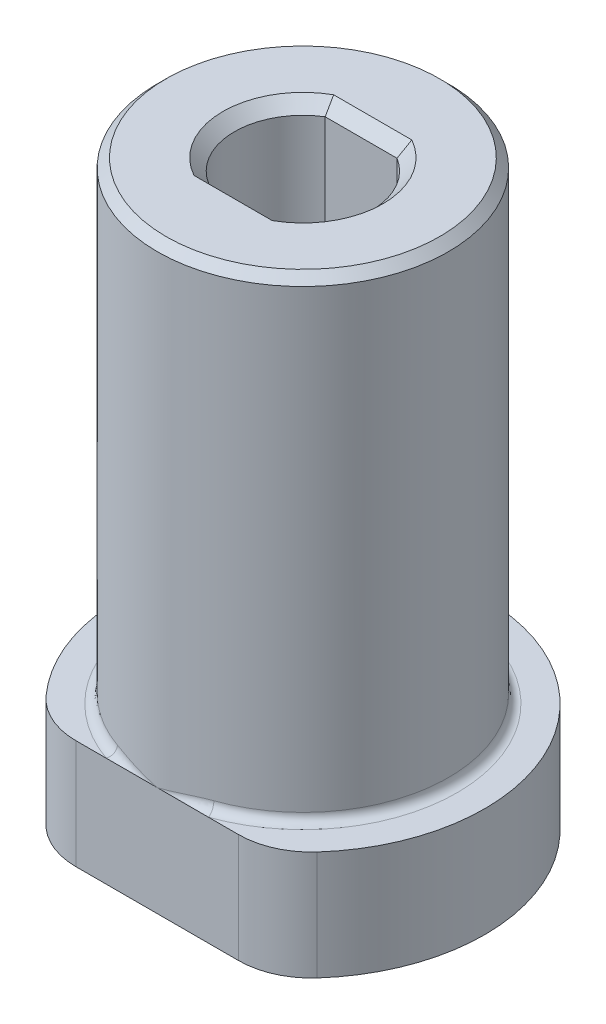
ISO-10303-21;
HEADER;
FILE_DESCRIPTION(('STEP AP214'),'2;1');
FILE_NAME('part.step','',(''),(''),'','','');
FILE_SCHEMA(('AUTOMOTIVE_DESIGN { 1 0 10303 214 1 1 1 1 }'));
ENDSEC;
DATA;
#1=APPLICATION_CONTEXT('core data for automotive mechanical design processes');
#2=APPLICATION_PROTOCOL_DEFINITION('international standard','automotive_design',2000,#1);
#3=PRODUCT_CONTEXT('',#1,'mechanical');
#4=PRODUCT('Part','Part','',(#3));
#5=PRODUCT_RELATED_PRODUCT_CATEGORY('part','',(#4));
#6=PRODUCT_DEFINITION_FORMATION('','',#4);
#7=PRODUCT_DEFINITION_CONTEXT('part definition',#1,'design');
#8=PRODUCT_DEFINITION('design','',#6,#7);
#9=PRODUCT_DEFINITION_SHAPE('','',#8);
#10=(LENGTH_UNIT() NAMED_UNIT(*) SI_UNIT(.MILLI.,.METRE.));
#11=(NAMED_UNIT(*) PLANE_ANGLE_UNIT() SI_UNIT($,.RADIAN.));
#12=(NAMED_UNIT(*) SI_UNIT($,.STERADIAN.) SOLID_ANGLE_UNIT());
#13=UNCERTAINTY_MEASURE_WITH_UNIT(LENGTH_MEASURE(1.E-05),#10,'distance_accuracy_value','');
#14=(GEOMETRIC_REPRESENTATION_CONTEXT(3) GLOBAL_UNCERTAINTY_ASSIGNED_CONTEXT((#13)) GLOBAL_UNIT_ASSIGNED_CONTEXT((#10,
#11,#12)) REPRESENTATION_CONTEXT('',''));
#15=CARTESIAN_POINT('',(0.,0.,0.));
#16=DIRECTION('',(0.,0.,1.));
#17=DIRECTION('',(1.,0.,0.));
#18=AXIS2_PLACEMENT_3D('',#15,#16,#17);
#19=CARTESIAN_POINT('',(0.,25.4,0.));
#20=DIRECTION('',(0.,-1.,0.));
#21=DIRECTION('',(0.,0.,-1.));
#22=AXIS2_PLACEMENT_3D('',#19,#20,#21);
#23=CYLINDRICAL_SURFACE('',#22,6.35);
#24=CARTESIAN_POINT('',(0.,25.019,0.));
#25=DIRECTION('',(0.,1.,0.));
#26=DIRECTION('',(0.,0.,1.));
#27=AXIS2_PLACEMENT_3D('',#24,#25,#26);
#28=CIRCLE('',#27,6.35);
#29=CARTESIAN_POINT('',(0.,25.019,6.35));
#30=VERTEX_POINT('',#29);
#31=EDGE_CURVE('E12',#30,#30,#28,.F.);
#32=ORIENTED_EDGE('',*,*,#31,.T.);
#33=EDGE_LOOP('',(#32));
#34=FACE_BOUND('',#33,.T.);
#35=CARTESIAN_POINT('',(-2.64079902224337,5.06724114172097,5.77483164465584));
#36=CARTESIAN_POINT('',(-2.5793391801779,4.85068522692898,5.80293689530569));
#37=CARTESIAN_POINT('',(-2.63299473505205,4.74749010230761,5.99770734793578));
#38=CARTESIAN_POINT('',(-2.68665028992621,4.64429497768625,6.19247780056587));
#39=CARTESIAN_POINT('',(-2.79924696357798,4.7625,6.35));
#40=CARTESIAN_POINT('',(-2.6233228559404,5.07359151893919,5.78282381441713));
#41=CARTESIAN_POINT('',(-2.56624090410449,4.85864058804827,5.80870378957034));
#42=CARTESIAN_POINT('',(-2.61912385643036,4.75403643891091,5.999442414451));
#43=CARTESIAN_POINT('',(-2.67210495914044,4.64938753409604,6.19016685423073));
#44=CARTESIAN_POINT('',(-2.7807222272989,4.7625,6.35));
#45=CARTESIAN_POINT('',(-2.605671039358,5.0793912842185,5.79079954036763));
#46=CARTESIAN_POINT('',(-2.55251150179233,4.86622995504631,5.81470706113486));
#47=CARTESIAN_POINT('',(-2.60469134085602,4.76037925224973,6.00152016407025));
#48=CARTESIAN_POINT('',(-2.65696733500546,4.65448930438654,6.18831767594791));
#49=CARTESIAN_POINT('',(-2.76201130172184,4.7625,6.35));
#50=CARTESIAN_POINT('',(-2.57008833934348,5.09001659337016,5.80667927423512));
#51=CARTESIAN_POINT('',(-2.52410761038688,4.88062521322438,5.82701755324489));
#52=CARTESIAN_POINT('',(-2.5749205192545,4.77261497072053,6.00621849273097));
#53=CARTESIAN_POINT('',(-2.62582765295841,4.66456572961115,6.18540497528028));
#54=CARTESIAN_POINT('',(-2.72429363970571,4.7625,6.35));
#55=CARTESIAN_POINT('',(-2.55215762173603,5.09484269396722,5.81458332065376));
#56=CARTESIAN_POINT('',(-2.50943374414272,4.88743952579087,5.83332523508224));
#57=CARTESIAN_POINT('',(-2.55958273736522,4.7785081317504,6.00883875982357));
#58=CARTESIAN_POINT('',(-2.6098250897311,4.66954336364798,6.18433540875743));
#59=CARTESIAN_POINT('',(-2.70528707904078,4.7625,6.35));
#60=CARTESIAN_POINT('',(-2.49811443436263,5.10803879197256,5.83810455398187));
#61=CARTESIAN_POINT('',(-2.4645099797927,4.90665701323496,5.85243943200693));
#62=CARTESIAN_POINT('',(-2.51259016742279,4.79543183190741,6.01728947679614));
#63=CARTESIAN_POINT('',(-2.56103864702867,4.68407352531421,6.18207346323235));
#64=CARTESIAN_POINT('',(-2.64800130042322,4.7625,6.35));
#65=CARTESIAN_POINT('',(-2.46166368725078,5.11515676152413,5.85357078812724));
#66=CARTESIAN_POINT('',(-2.43301723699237,4.91802807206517,5.86558774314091));
#67=CARTESIAN_POINT('',(-2.47988531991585,4.80573941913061,6.02371984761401));
#68=CARTESIAN_POINT('',(-2.52710010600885,4.69335401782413,6.18178137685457));
#69=CARTESIAN_POINT('',(-2.6093635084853,4.7625,6.35));
#70=CARTESIAN_POINT('',(-2.38847508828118,5.12670219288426,5.88381196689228));
#71=CARTESIAN_POINT('',(-2.36838343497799,4.93800653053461,5.89193648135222));
#72=CARTESIAN_POINT('',(-2.41293131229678,4.82439155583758,6.03742606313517));
#73=CARTESIAN_POINT('',(-2.45781822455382,4.71068229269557,6.18284584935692));
#74=CARTESIAN_POINT('',(-2.53178359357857,4.7625,6.35));
#75=CARTESIAN_POINT('',(-2.35174199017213,5.13115108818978,5.89859151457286));
#76=CARTESIAN_POINT('',(-2.33524096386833,4.94667356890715,5.90514869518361));
#77=CARTESIAN_POINT('',(-2.3786968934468,4.83275140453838,6.04469459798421));
#78=CARTESIAN_POINT('',(-2.42246682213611,4.7187607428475,6.18417310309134));
#79=CARTESIAN_POINT('',(-2.4928465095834,4.7625,6.35));
#80=CARTESIAN_POINT('',(-2.27782984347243,5.1379218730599,5.9275263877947));
#81=CARTESIAN_POINT('',(-2.26760356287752,4.96174071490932,5.93143301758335));
#82=CARTESIAN_POINT('',(-2.30893967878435,4.84778638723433,6.05971545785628));
#83=CARTESIAN_POINT('',(-2.3505869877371,4.73376580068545,6.18793067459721));
#84=CARTESIAN_POINT('',(-2.41449963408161,4.7625,6.35));
#85=CARTESIAN_POINT('',(-2.24065045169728,5.14024200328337,5.94168118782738));
#86=CARTESIAN_POINT('',(-2.23308549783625,4.96816670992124,5.94451949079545));
#87=CARTESIAN_POINT('',(-2.27341584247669,4.85446012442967,6.067468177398));
#88=CARTESIAN_POINT('',(-2.31403186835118,4.74070926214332,6.1903539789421));
#89=CARTESIAN_POINT('',(-2.37508947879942,4.7625,6.35));
#90=CARTESIAN_POINT('',(-2.11485259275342,5.14509343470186,5.98822036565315));
#91=CARTESIAN_POINT('',(-2.11581483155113,4.98642723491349,5.98777192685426));
#92=CARTESIAN_POINT('',(-2.1521986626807,4.87440421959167,6.09389828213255));
#93=CARTESIAN_POINT('',(-2.19017422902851,4.76211293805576,6.19967896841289));
#94=CARTESIAN_POINT('',(-2.2417437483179,4.7625,6.35));
#95=CARTESIAN_POINT('',(-2.02550531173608,5.14356417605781,6.01902813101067));
#96=CARTESIAN_POINT('',(-2.03001882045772,4.99403630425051,6.01747175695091));
#97=CARTESIAN_POINT('',(-2.06441104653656,4.88419511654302,6.11299941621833));
#98=CARTESIAN_POINT('',(-2.10009644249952,4.7742520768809,6.20825988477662));
#99=CARTESIAN_POINT('',(-2.14703563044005,4.7625,6.35));
#100=CARTESIAN_POINT('',(-1.84584346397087,5.13371963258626,6.07653546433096));
#101=CARTESIAN_POINT('',(-1.85577767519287,5.00136043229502,6.07346602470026));
#102=CARTESIAN_POINT('',(-1.88616403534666,4.89739363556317,6.15017194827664));
#103=CARTESIAN_POINT('',(-1.91782444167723,4.79333851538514,6.22660971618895));
#104=CARTESIAN_POINT('',(-1.95659407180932,4.7625,6.35));
#105=CARTESIAN_POINT('',(-1.75552822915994,5.12539931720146,6.10323196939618));
#106=CARTESIAN_POINT('',(-1.7670774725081,5.00119418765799,6.09989984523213));
#107=CARTESIAN_POINT('',(-1.7957027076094,4.90079651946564,6.16824257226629));
#108=CARTESIAN_POINT('',(-1.82535457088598,4.80038769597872,6.23639323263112));
#109=CARTESIAN_POINT('',(-1.8608599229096,4.7625,6.35));
#110=CARTESIAN_POINT('',(-1.57362316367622,5.10374807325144,6.1526544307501));
#111=CARTESIAN_POINT('',(-1.58744962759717,4.99509068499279,6.14909134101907));
#112=CARTESIAN_POINT('',(-1.61247376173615,4.90277946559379,6.20254660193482));
#113=CARTESIAN_POINT('',(-1.63852691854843,4.81045715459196,6.25580907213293));
#114=CARTESIAN_POINT('',(-1.66804055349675,4.7625,6.35));
#115=CARTESIAN_POINT('',(-1.48202885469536,5.09037997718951,6.17534905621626));
#116=CARTESIAN_POINT('',(-1.49628421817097,4.9891665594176,6.17193009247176));
#117=CARTESIAN_POINT('',(-1.51969392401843,4.90132310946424,6.21876518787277));
#118=CARTESIAN_POINT('',(-1.54392024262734,4.81350623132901,6.26546855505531));
#119=CARTESIAN_POINT('',(-1.57095058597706,4.7625,6.35));
#120=CARTESIAN_POINT('',(-1.29843010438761,5.05997094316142,6.21654539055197));
#121=CARTESIAN_POINT('',(-1.3129663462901,4.9730373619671,6.21350226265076));
#122=CARTESIAN_POINT('',(-1.33307050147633,4.89471302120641,6.24868289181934));
#123=CARTESIAN_POINT('',(-1.3539802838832,4.81641954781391,6.28373518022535));
#124=CARTESIAN_POINT('',(-1.37633591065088,4.7625,6.35));
#125=CARTESIAN_POINT('',(-1.20642553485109,5.0429287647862,6.23504567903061));
#126=CARTESIAN_POINT('',(-1.2206222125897,4.96285019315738,6.23231503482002));
#127=CARTESIAN_POINT('',(-1.23922656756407,4.88955803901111,6.26238115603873));
#128=CARTESIAN_POINT('',(-1.25844595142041,4.81631336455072,6.29237096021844));
#129=CARTESIAN_POINT('',(-1.27881106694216,4.7625,6.35));
#130=CARTESIAN_POINT('',(-0.93143973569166,4.98811726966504,6.28406074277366));
#131=CARTESIAN_POINT('',(-0.945044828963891,4.92795748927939,6.2820290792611));
#132=CARTESIAN_POINT('',(-0.95813022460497,4.87012373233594,6.29903191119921));
#133=CARTESIAN_POINT('',(-0.97364970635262,4.81244851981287,6.31570976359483));
#134=CARTESIAN_POINT('',(-0.987326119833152,4.7625,6.35));
#135=CARTESIAN_POINT('',(-0.74804435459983,4.94645689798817,6.30847855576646));
#136=CARTESIAN_POINT('',(-0.75905650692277,4.89858900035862,6.30725366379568));
#137=CARTESIAN_POINT('',(-0.769852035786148,4.85185765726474,6.31782263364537));
#138=CARTESIAN_POINT('',(-0.781830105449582,4.80524353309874,6.32830982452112));
#139=CARTESIAN_POINT('',(-0.79292701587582,4.7625,6.35));
#140=CARTESIAN_POINT('',(-0.381426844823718,4.85863306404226,6.34119713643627));
#141=CARTESIAN_POINT('',(-0.38769428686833,4.83467802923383,6.34087771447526));
#142=CARTESIAN_POINT('',(-0.392861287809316,4.81053380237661,6.34311097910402));
#143=CARTESIAN_POINT('',(-0.399157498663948,4.7865256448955,6.34527092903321));
#144=CARTESIAN_POINT('',(-0.404312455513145,4.7625,6.35));
#145=CARTESIAN_POINT('',(-0.198205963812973,4.81248407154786,6.34954800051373));
#146=CARTESIAN_POINT('',(-0.201193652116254,4.79999014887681,6.34953328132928));
#147=CARTESIAN_POINT('',(-0.204151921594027,4.78749116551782,6.34964681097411));
#148=CARTESIAN_POINT('',(-0.207140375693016,4.77499581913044,6.34975887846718));
#149=CARTESIAN_POINT('',(-0.210098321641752,4.7625,6.35));
#150=CARTESIAN_POINT('',(-0.0100395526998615,4.76503187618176,6.34999404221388));
#151=CARTESIAN_POINT('',(-0.0101901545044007,4.76439890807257,6.34999389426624));
#152=CARTESIAN_POINT('',(-0.0103407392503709,4.76376593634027,6.34999537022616));
#153=CARTESIAN_POINT('',(-0.0104913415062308,4.76313296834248,6.34999688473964));
#154=CARTESIAN_POINT('',(-0.0106419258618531,4.7625,6.35));
#155=CARTESIAN_POINT('',(-0.00501974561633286,4.7637659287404,6.34999999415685));
#156=CARTESIAN_POINT('',(-0.00509503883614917,4.76344944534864,6.35000002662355));
#157=CARTESIAN_POINT('',(-0.00517033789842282,4.76313296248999,6.3500000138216));
#158=CARTESIAN_POINT('',(-0.00524563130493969,4.76281648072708,6.35000004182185));
#159=CARTESIAN_POINT('',(-0.00532093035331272,4.7625,6.35));
#160=CARTESIAN_POINT('',(0.,4.7625,6.35));
#161=CARTESIAN_POINT('',(0.,4.7625,6.35));
#162=CARTESIAN_POINT('',(0.,4.7625,6.35));
#163=CARTESIAN_POINT('',(0.,4.7625,6.35));
#164=CARTESIAN_POINT('',(0.,4.7625,6.35));
#165=(BOUNDED_SURFACE() B_SPLINE_SURFACE(3,2,((#35,#36,#37,#38,#39),(#40,#41,#42,#43,#44),(#45,
#46,#47,#48,#49),(#50,#51,#52,#53,#54),(#55,#56,#57,#58,#59),(#60,#61,#62,#63,#64),(#65,#66,#67,
#68,#69),(#70,#71,#72,#73,#74),(#75,#76,#77,#78,#79),(#80,#81,#82,#83,#84),(#85,#86,#87,#88,
#89),(#90,#91,#92,#93,#94),(#95,#96,#97,#98,#99),(#100,#101,#102,#103,#104),(#105,#106,#107,
#108,#109),(#110,#111,#112,#113,#114),(#115,#116,#117,#118,#119),(#120,#121,#122,#123,#124),
(#125,#126,#127,#128,#129),(#130,#131,#132,#133,#134),(#135,#136,#137,#138,#139),(#140,#141,
#142,#143,#144),(#145,#146,#147,#148,#149),(#150,#151,#152,#153,#154),(#155,#156,#157,#158,
#159),(#160,#161,#162,#163,#164)),.UNSPECIFIED.,.F.,.F.,.F.) B_SPLINE_SURFACE_WITH_KNOTS((4,2,2,
2,2,2,2,2,2,2,2,2,4),(3,2,3),(0.,0.0639886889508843,0.127940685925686,0.255527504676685,
0.382075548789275,0.508728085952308,0.808795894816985,1.10908618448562,1.41163208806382,
1.71428029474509,2.31481126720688,2.91346674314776,2.92987528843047),(0.,0.5,1.),
.UNSPECIFIED.) GEOMETRIC_REPRESENTATION_ITEM() RATIONAL_B_SPLINE_SURFACE(((1.,0.859223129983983,
1.,0.859223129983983,1.),(1.,0.862193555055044,1.,0.862193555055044,1.),(1.,0.865061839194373,
1.,0.865061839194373,1.),(1.,0.870611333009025,1.,0.870611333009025,1.),(1.,0.873292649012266,
1.,0.873292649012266,1.),(1.,0.881073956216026,1.,0.881073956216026,1.),(1.,0.8859258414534,1.,
0.8859258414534,1.),(1.,0.895045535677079,1.,0.895045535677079,1.),(1.,0.899317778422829,1.,
0.899317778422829,1.),(1.,0.907413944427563,1.,0.907413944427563,1.),(1.,0.911237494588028,1.,
0.911237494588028,1.),(1.,0.923477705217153,1.,0.923477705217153,1.),(1.,0.931015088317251,1.,
0.931015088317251,1.),(1.,0.944520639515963,1.,0.944520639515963,1.),(1.,0.950487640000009,1.,
0.950487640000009,1.),(1.,0.96121129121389,1.,0.96121129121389,1.),(1.,0.965958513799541,1.,
0.965958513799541,1.),(1.,0.974391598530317,1.,0.974391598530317,1.),(1.,0.978077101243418,1.,
0.978077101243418,1.),(1.,0.98770179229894,1.,0.98770179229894,1.),(1.,0.992288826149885,1.,
0.992288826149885,1.),(1.,0.998391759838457,1.,0.998391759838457,1.),(1.,0.999917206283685,1.,
0.999917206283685,1.),(1.,0.999998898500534,1.,0.999998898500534,1.),(1.,0.999999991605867,1.,
0.999999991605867,1.),(1.,1.,1.,1.,1.))) REPRESENTATION_ITEM('') SURFACE());
#166=CARTESIAN_POINT('',(-2.64079902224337,5.06724114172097,5.77483164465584));
#167=CARTESIAN_POINT('',(-2.6233228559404,5.07359151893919,5.78282381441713));
#168=CARTESIAN_POINT('',(-2.605671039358,5.0793912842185,5.79079954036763));
#169=CARTESIAN_POINT('',(-2.57008833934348,5.09001659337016,5.80667927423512));
#170=CARTESIAN_POINT('',(-2.55215762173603,5.09484269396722,5.81458332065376));
#171=CARTESIAN_POINT('',(-2.49811443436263,5.10803879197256,5.83810455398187));
#172=CARTESIAN_POINT('',(-2.46166368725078,5.11515676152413,5.85357078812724));
#173=CARTESIAN_POINT('',(-2.38847508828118,5.12670219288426,5.88381196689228));
#174=CARTESIAN_POINT('',(-2.35174199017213,5.13115108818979,5.89859151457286));
#175=CARTESIAN_POINT('',(-2.27782984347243,5.1379218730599,5.9275263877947));
#176=CARTESIAN_POINT('',(-2.24065045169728,5.14024200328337,5.94168118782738));
#177=CARTESIAN_POINT('',(-2.11485259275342,5.14509343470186,5.98822036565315));
#178=CARTESIAN_POINT('',(-2.02550531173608,5.14356417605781,6.01902813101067));
#179=CARTESIAN_POINT('',(-1.84584346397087,5.13371963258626,6.07653546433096));
#180=CARTESIAN_POINT('',(-1.75552822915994,5.12539931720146,6.10323196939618));
#181=CARTESIAN_POINT('',(-1.57362316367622,5.10374807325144,6.1526544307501));
#182=CARTESIAN_POINT('',(-1.48202885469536,5.09037997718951,6.17534905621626));
#183=CARTESIAN_POINT('',(-1.29843010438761,5.05997094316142,6.21654539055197));
#184=CARTESIAN_POINT('',(-1.20642553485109,5.0429287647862,6.23504567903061));
#185=CARTESIAN_POINT('',(-0.93143973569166,4.98811726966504,6.28406074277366));
#186=CARTESIAN_POINT('',(-0.748044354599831,4.94645689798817,6.30847855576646));
#187=CARTESIAN_POINT('',(-0.381426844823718,4.85863306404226,6.34119713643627));
#188=CARTESIAN_POINT('',(-0.198205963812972,4.81248407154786,6.34954800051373));
#189=CARTESIAN_POINT('',(-0.0100395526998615,4.76503187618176,6.34999404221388));
#190=CARTESIAN_POINT('',(-0.00501974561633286,4.7637659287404,6.34999999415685));
#191=CARTESIAN_POINT('',(0.,4.7625,6.35));
#192=B_SPLINE_CURVE_WITH_KNOTS('',3,(#166,#167,#168,#169,#170,#171,#172,#173,#174,#175,#176,
#177,#178,#179,#180,#181,#182,#183,#184,#185,#186,#187,#188,#189,#190,#191),.UNSPECIFIED.,.F.,
.F.,(4,2,2,2,2,2,2,2,2,2,2,2,4),(0.,0.0639886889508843,0.127940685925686,0.255527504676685,
0.382075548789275,0.508728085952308,0.808795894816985,1.10908618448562,1.41163208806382,
1.71428029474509,2.31481126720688,2.91346674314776,2.92987528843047),.UNSPECIFIED.);
#193=CARTESIAN_POINT('',(-2.10609082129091,5.1435,5.99056603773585));
#194=VERTEX_POINT('',#193);
#195=CARTESIAN_POINT('',(0.,4.7625,6.35));
#196=VERTEX_POINT('',#195);
#197=EDGE_CURVE('E140',#194,#196,#192,.T.);
#198=ORIENTED_EDGE('',*,*,#197,.T.);
#199=CARTESIAN_POINT('',(2.79924696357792,4.7625,6.35));
#200=CARTESIAN_POINT('',(2.68665028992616,4.64429497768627,6.19247780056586));
#201=CARTESIAN_POINT('',(2.63299473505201,4.74749010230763,5.99770734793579));
#202=CARTESIAN_POINT('',(2.57933918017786,4.850685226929,5.80293689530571));
#203=CARTESIAN_POINT('',(2.64079902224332,5.06724114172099,5.77483164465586));
#204=CARTESIAN_POINT('',(2.78072222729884,4.7625,6.35));
#205=CARTESIAN_POINT('',(2.6721049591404,4.64938753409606,6.19016685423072));
#206=CARTESIAN_POINT('',(2.61912385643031,4.75403643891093,5.99944241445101));
#207=CARTESIAN_POINT('',(2.56624090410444,4.85864058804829,5.80870378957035));
#208=CARTESIAN_POINT('',(2.62332285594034,5.07359151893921,5.78282381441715));
#209=CARTESIAN_POINT('',(2.76201130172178,4.7625,6.35));
#210=CARTESIAN_POINT('',(2.65696733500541,4.65448930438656,6.1883176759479));
#211=CARTESIAN_POINT('',(2.60469134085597,4.76037925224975,6.00152016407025));
#212=CARTESIAN_POINT('',(2.55251150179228,4.86622995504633,5.81470706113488));
#213=CARTESIAN_POINT('',(2.60567103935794,5.07939128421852,5.79079954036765));
#214=CARTESIAN_POINT('',(2.72429363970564,4.7625,6.35));
#215=CARTESIAN_POINT('',(2.62582765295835,4.66456572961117,6.18540497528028));
#216=CARTESIAN_POINT('',(2.57492051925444,4.77261497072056,6.00621849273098));
#217=CARTESIAN_POINT('',(2.52410761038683,4.8806252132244,5.82701755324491));
#218=CARTESIAN_POINT('',(2.57008833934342,5.09001659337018,5.80667927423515));
#219=CARTESIAN_POINT('',(2.7052870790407,4.7625,6.35));
#220=CARTESIAN_POINT('',(2.60982508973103,4.66954336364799,6.18433540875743));
#221=CARTESIAN_POINT('',(2.55958273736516,4.77850813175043,6.00883875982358));
#222=CARTESIAN_POINT('',(2.50943374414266,4.88743952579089,5.83332523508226));
#223=CARTESIAN_POINT('',(2.55215762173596,5.09484269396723,5.81458332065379));
#224=CARTESIAN_POINT('',(2.64800130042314,4.7625,6.35));
#225=CARTESIAN_POINT('',(2.5610386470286,4.68407352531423,6.18207346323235));
#226=CARTESIAN_POINT('',(2.51259016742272,4.79543183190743,6.01728947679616));
#227=CARTESIAN_POINT('',(2.46450997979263,4.90665701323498,5.85243943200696));
#228=CARTESIAN_POINT('',(2.49811443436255,5.10803879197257,5.8381045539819));
#229=CARTESIAN_POINT('',(2.60936350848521,4.7625,6.35));
#230=CARTESIAN_POINT('',(2.52710010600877,4.69335401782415,6.18178137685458));
#231=CARTESIAN_POINT('',(2.47988531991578,4.80573941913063,6.02371984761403));
#232=CARTESIAN_POINT('',(2.43301723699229,4.91802807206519,5.86558774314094));
#233=CARTESIAN_POINT('',(2.46166368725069,5.11515676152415,5.85357078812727));
#234=CARTESIAN_POINT('',(2.53178359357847,4.7625,6.35));
#235=CARTESIAN_POINT('',(2.45781822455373,4.71068229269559,6.18284584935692));
#236=CARTESIAN_POINT('',(2.41293131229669,4.8243915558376,6.03742606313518));
#237=CARTESIAN_POINT('',(2.3683834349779,4.93800653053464,5.89193648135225));
#238=CARTESIAN_POINT('',(2.38847508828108,5.12670219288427,5.88381196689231));
#239=CARTESIAN_POINT('',(2.49284650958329,4.7625,6.35));
#240=CARTESIAN_POINT('',(2.42246682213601,4.71876074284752,6.18417310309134));
#241=CARTESIAN_POINT('',(2.3786968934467,4.83275140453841,6.04469459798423));
#242=CARTESIAN_POINT('',(2.33524096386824,4.94667356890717,5.90514869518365));
#243=CARTESIAN_POINT('',(2.35174199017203,5.1311510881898,5.8985915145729));
#244=CARTESIAN_POINT('',(2.41449963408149,4.7625,6.35));
#245=CARTESIAN_POINT('',(2.35058698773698,4.73376580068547,6.18793067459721));
#246=CARTESIAN_POINT('',(2.30893967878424,4.84778638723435,6.05971545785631));
#247=CARTESIAN_POINT('',(2.26760356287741,4.96174071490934,5.93143301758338));
#248=CARTESIAN_POINT('',(2.27782984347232,5.1379218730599,5.92752638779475));
#249=CARTESIAN_POINT('',(2.37508947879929,4.7625,6.35));
#250=CARTESIAN_POINT('',(2.31403186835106,4.74070926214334,6.19035397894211));
#251=CARTESIAN_POINT('',(2.27341584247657,4.85446012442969,6.06746817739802));
#252=CARTESIAN_POINT('',(2.23308549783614,4.96816670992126,5.9445194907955));
#253=CARTESIAN_POINT('',(2.24065045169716,5.14024200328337,5.94168118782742));
#254=CARTESIAN_POINT('',(2.24174374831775,4.7625,6.35));
#255=CARTESIAN_POINT('',(2.19017422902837,4.76211293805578,6.19967896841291));
#256=CARTESIAN_POINT('',(2.15219866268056,4.87440421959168,6.09389828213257));
#257=CARTESIAN_POINT('',(2.11581483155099,4.9864272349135,5.98777192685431));
#258=CARTESIAN_POINT('',(2.11485259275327,5.14509343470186,5.9882203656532));
#259=CARTESIAN_POINT('',(2.14703563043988,4.7625,6.35));
#260=CARTESIAN_POINT('',(2.10009644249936,4.77425207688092,6.20825988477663));
#261=CARTESIAN_POINT('',(2.06441104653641,4.88419511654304,6.11299941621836));
#262=CARTESIAN_POINT('',(2.03001882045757,4.99403630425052,6.01747175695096));
#263=CARTESIAN_POINT('',(2.02550531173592,5.14356417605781,6.01902813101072));
#264=CARTESIAN_POINT('',(1.95659407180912,4.7625,6.35));
#265=CARTESIAN_POINT('',(1.91782444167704,4.79333851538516,6.22660971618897));
#266=CARTESIAN_POINT('',(1.88616403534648,4.89739363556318,6.15017194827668));
#267=CARTESIAN_POINT('',(1.85577767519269,5.00136043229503,6.07346602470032));
#268=CARTESIAN_POINT('',(1.84584346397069,5.13371963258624,6.07653546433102));
#269=CARTESIAN_POINT('',(1.86085992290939,4.7625,6.35));
#270=CARTESIAN_POINT('',(1.82535457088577,4.80038769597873,6.23639323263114));
#271=CARTESIAN_POINT('',(1.7957027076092,4.90079651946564,6.16824257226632));
#272=CARTESIAN_POINT('',(1.76707747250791,5.00119418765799,6.09989984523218));
#273=CARTESIAN_POINT('',(1.75552822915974,5.12539931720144,6.10323196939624));
#274=CARTESIAN_POINT('',(1.66804055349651,4.7625,6.35));
#275=CARTESIAN_POINT('',(1.6385269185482,4.81045715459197,6.25580907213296));
#276=CARTESIAN_POINT('',(1.61247376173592,4.90277946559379,6.20254660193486));
#277=CARTESIAN_POINT('',(1.58744962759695,4.99509068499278,6.14909134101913));
#278=CARTESIAN_POINT('',(1.573623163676,5.10374807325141,6.15265443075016));
#279=CARTESIAN_POINT('',(1.57095058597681,4.7625,6.35));
#280=CARTESIAN_POINT('',(1.54392024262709,4.81350623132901,6.26546855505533));
#281=CARTESIAN_POINT('',(1.51969392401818,4.90132310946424,6.21876518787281));
#282=CARTESIAN_POINT('',(1.49628421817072,4.98916655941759,6.17193009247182));
#283=CARTESIAN_POINT('',(1.48202885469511,5.09037997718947,6.17534905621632));
#284=CARTESIAN_POINT('',(1.37633591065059,4.7625,6.35));
#285=CARTESIAN_POINT('',(1.35398028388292,4.81641954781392,6.28373518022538));
#286=CARTESIAN_POINT('',(1.33307050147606,4.8947130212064,6.24868289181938));
#287=CARTESIAN_POINT('',(1.31296634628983,4.97303736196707,6.21350226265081));
#288=CARTESIAN_POINT('',(1.29843010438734,5.05997094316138,6.21654539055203));
#289=CARTESIAN_POINT('',(1.27881106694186,4.7625,6.35));
#290=CARTESIAN_POINT('',(1.25844595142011,4.81631336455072,6.29237096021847));
#291=CARTESIAN_POINT('',(1.23922656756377,4.88955803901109,6.26238115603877));
#292=CARTESIAN_POINT('',(1.22062221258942,4.96285019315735,6.23231503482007));
#293=CARTESIAN_POINT('',(1.20642553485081,5.04292876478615,6.23504567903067));
#294=CARTESIAN_POINT('',(0.987326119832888,4.7625,6.35));
#295=CARTESIAN_POINT('',(0.973649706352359,4.81244851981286,6.31570976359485));
#296=CARTESIAN_POINT('',(0.958130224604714,4.87012373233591,6.29903191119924));
#297=CARTESIAN_POINT('',(0.945044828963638,4.92795748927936,6.28202907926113));
#298=CARTESIAN_POINT('',(0.931439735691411,4.98811726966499,6.2840607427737));
#299=CARTESIAN_POINT('',(0.792927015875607,4.7625,6.35));
#300=CARTESIAN_POINT('',(0.781830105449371,4.80524353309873,6.32830982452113));
#301=CARTESIAN_POINT('',(0.769852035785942,4.85185765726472,6.31782263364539));
#302=CARTESIAN_POINT('',(0.759056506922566,4.89858900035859,6.3072536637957));
#303=CARTESIAN_POINT('',(0.748044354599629,4.94645689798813,6.30847855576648));
#304=CARTESIAN_POINT('',(0.40431245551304,4.7625,6.35));
#305=CARTESIAN_POINT('',(0.399157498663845,4.78652564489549,6.34527092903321));
#306=CARTESIAN_POINT('',(0.392861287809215,4.8105338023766,6.34311097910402));
#307=CARTESIAN_POINT('',(0.38769428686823,4.83467802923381,6.34087771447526));
#308=CARTESIAN_POINT('',(0.381426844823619,4.85863306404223,6.34119713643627));
#309=CARTESIAN_POINT('',(0.210098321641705,4.7625,6.35));
#310=CARTESIAN_POINT('',(0.20714037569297,4.77499581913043,6.34975887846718));
#311=CARTESIAN_POINT('',(0.204151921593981,4.7874911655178,6.34964681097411));
#312=CARTESIAN_POINT('',(0.201193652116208,4.79999014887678,6.34953328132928));
#313=CARTESIAN_POINT('',(0.198205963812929,4.81248407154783,6.34954800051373));
#314=CARTESIAN_POINT('',(0.0106419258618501,4.7625,6.35));
#315=CARTESIAN_POINT('',(0.0104913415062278,4.76313296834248,6.34999688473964));
#316=CARTESIAN_POINT('',(0.0103407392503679,4.76376593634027,6.34999537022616));
#317=CARTESIAN_POINT('',(0.0101901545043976,4.76439890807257,6.34999389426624));
#318=CARTESIAN_POINT('',(0.0100395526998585,4.76503187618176,6.34999404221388));
#319=CARTESIAN_POINT('',(0.00532093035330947,4.7625,6.35));
#320=CARTESIAN_POINT('',(0.00524563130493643,4.76281648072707,6.35000004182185));
#321=CARTESIAN_POINT('',(0.00517033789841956,4.76313296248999,6.3500000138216));
#322=CARTESIAN_POINT('',(0.00509503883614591,4.76344944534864,6.35000002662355));
#323=CARTESIAN_POINT('',(0.0050197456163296,4.7637659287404,6.34999999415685));
#324=CARTESIAN_POINT('',(0.,4.7625,6.35));
#325=CARTESIAN_POINT('',(0.,4.7625,6.35));
#326=CARTESIAN_POINT('',(0.,4.7625,6.35));
#327=CARTESIAN_POINT('',(0.,4.7625,6.35));
#328=CARTESIAN_POINT('',(0.,4.7625,6.35));
#329=(BOUNDED_SURFACE() B_SPLINE_SURFACE(3,2,((#199,#200,#201,#202,#203),(#204,#205,#206,#207,
#208),(#209,#210,#211,#212,#213),(#214,#215,#216,#217,#218),(#219,#220,#221,#222,#223),(#224,
#225,#226,#227,#228),(#229,#230,#231,#232,#233),(#234,#235,#236,#237,#238),(#239,#240,#241,#242,
#243),(#244,#245,#246,#247,#248),(#249,#250,#251,#252,#253),(#254,#255,#256,#257,#258),(#259,
#260,#261,#262,#263),(#264,#265,#266,#267,#268),(#269,#270,#271,#272,#273),(#274,#275,#276,#277,
#278),(#279,#280,#281,#282,#283),(#284,#285,#286,#287,#288),(#289,#290,#291,#292,#293),(#294,
#295,#296,#297,#298),(#299,#300,#301,#302,#303),(#304,#305,#306,#307,#308),(#309,#310,#311,#312,
#313),(#314,#315,#316,#317,#318),(#319,#320,#321,#322,#323),(#324,#325,#326,#327,#328)),
.UNSPECIFIED.,.F.,.F.,.F.) B_SPLINE_SURFACE_WITH_KNOTS((4,2,2,2,2,2,2,2,2,2,2,2,4),(3,2,3),(0.,
0.0639886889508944,0.127940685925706,0.255527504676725,0.382075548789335,0.508728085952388,
0.80879589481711,1.1090861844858,1.41163208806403,1.71428029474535,2.31481126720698,
2.9134667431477,2.92987528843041),(0.,0.5,1.),
.UNSPECIFIED.) GEOMETRIC_REPRESENTATION_ITEM() RATIONAL_B_SPLINE_SURFACE(((1.,0.859223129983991,
1.,0.859223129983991,1.),(1.,0.862193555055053,1.,0.862193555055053,1.),(1.,0.865061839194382,
1.,0.865061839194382,1.),(1.,0.870611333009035,1.,0.870611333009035,1.),(1.,0.873292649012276,
1.,0.873292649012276,1.),(1.,0.881073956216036,1.,0.881073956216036,1.),(1.,0.885925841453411,
1.,0.885925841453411,1.),(1.,0.89504553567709,1.,0.89504553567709,1.),(1.,0.89931777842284,1.,
0.89931777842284,1.),(1.,0.907413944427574,1.,0.907413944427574,1.),(1.,0.91123749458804,1.,
0.91123749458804,1.),(1.,0.923477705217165,1.,0.923477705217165,1.),(1.,0.931015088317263,1.,
0.931015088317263,1.),(1.,0.944520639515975,1.,0.944520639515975,1.),(1.,0.950487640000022,1.,
0.950487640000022,1.),(1.,0.961211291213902,1.,0.961211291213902,1.),(1.,0.965958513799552,1.,
0.965958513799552,1.),(1.,0.974391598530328,1.,0.974391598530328,1.),(1.,0.978077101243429,1.,
0.978077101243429,1.),(1.,0.987701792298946,1.,0.987701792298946,1.),(1.,0.992288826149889,1.,
0.992288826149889,1.),(1.,0.998391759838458,1.,0.998391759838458,1.),(1.,0.999917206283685,1.,
0.999917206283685,1.),(1.,0.999998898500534,1.,0.999998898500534,1.),(1.,0.999999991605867,1.,
0.999999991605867,1.),(1.,1.,1.,1.,1.))) REPRESENTATION_ITEM('') SURFACE());
#330=CARTESIAN_POINT('',(2.64079902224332,5.06724114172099,5.77483164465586));
#331=CARTESIAN_POINT('',(2.62332285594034,5.07359151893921,5.78282381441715));
#332=CARTESIAN_POINT('',(2.60567103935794,5.07939128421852,5.79079954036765));
#333=CARTESIAN_POINT('',(2.57008833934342,5.09001659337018,5.80667927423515));
#334=CARTESIAN_POINT('',(2.55215762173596,5.09484269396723,5.81458332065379));
#335=CARTESIAN_POINT('',(2.49811443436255,5.10803879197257,5.8381045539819));
#336=CARTESIAN_POINT('',(2.46166368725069,5.11515676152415,5.85357078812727));
#337=CARTESIAN_POINT('',(2.38847508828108,5.12670219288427,5.88381196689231));
#338=CARTESIAN_POINT('',(2.35174199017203,5.1311510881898,5.8985915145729));
#339=CARTESIAN_POINT('',(2.27782984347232,5.1379218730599,5.92752638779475));
#340=CARTESIAN_POINT('',(2.24065045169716,5.14024200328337,5.94168118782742));
#341=CARTESIAN_POINT('',(2.11485259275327,5.14509343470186,5.9882203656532));
#342=CARTESIAN_POINT('',(2.02550531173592,5.14356417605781,6.01902813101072));
#343=CARTESIAN_POINT('',(1.84584346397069,5.13371963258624,6.07653546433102));
#344=CARTESIAN_POINT('',(1.75552822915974,5.12539931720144,6.10323196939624));
#345=CARTESIAN_POINT('',(1.573623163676,5.10374807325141,6.15265443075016));
#346=CARTESIAN_POINT('',(1.48202885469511,5.09037997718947,6.17534905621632));
#347=CARTESIAN_POINT('',(1.29843010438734,5.05997094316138,6.21654539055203));
#348=CARTESIAN_POINT('',(1.20642553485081,5.04292876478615,6.23504567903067));
#349=CARTESIAN_POINT('',(0.931439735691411,4.98811726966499,6.2840607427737));
#350=CARTESIAN_POINT('',(0.748044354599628,4.94645689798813,6.30847855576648));
#351=CARTESIAN_POINT('',(0.38142684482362,4.85863306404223,6.34119713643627));
#352=CARTESIAN_POINT('',(0.198205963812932,4.81248407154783,6.34954800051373));
#353=CARTESIAN_POINT('',(0.0100395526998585,4.76503187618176,6.34999404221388));
#354=CARTESIAN_POINT('',(0.0050197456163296,4.7637659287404,6.34999999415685));
#355=CARTESIAN_POINT('',(0.,4.7625,6.35));
#356=B_SPLINE_CURVE_WITH_KNOTS('',3,(#330,#331,#332,#333,#334,#335,#336,#337,#338,#339,#340,
#341,#342,#343,#344,#345,#346,#347,#348,#349,#350,#351,#352,#353,#354,#355),.UNSPECIFIED.,.F.,
.F.,(4,2,2,2,2,2,2,2,2,2,2,2,4),(0.,0.0639886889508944,0.127940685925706,0.255527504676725,
0.382075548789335,0.508728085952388,0.80879589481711,1.1090861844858,1.41163208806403,
1.71428029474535,2.31481126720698,2.9134667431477,2.92987528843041),.UNSPECIFIED.);
#357=CARTESIAN_POINT('',(2.1060908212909,5.1435,5.99056603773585));
#358=VERTEX_POINT('',#357);
#359=EDGE_CURVE('E143',#196,#358,#356,.F.);
#360=ORIENTED_EDGE('',*,*,#359,.T.);
#361=CARTESIAN_POINT('',(0.,5.1435,0.));
#362=DIRECTION('',(0.,-1.,0.));
#363=DIRECTION('',(0.,0.,-1.));
#364=AXIS2_PLACEMENT_3D('',#361,#362,#363);
#365=CIRCLE('',#364,6.35);
#366=EDGE_CURVE('E146',#358,#194,#365,.F.);
#367=ORIENTED_EDGE('',*,*,#366,.T.);
#368=EDGE_LOOP('',(#198,#360,#367));
#369=FACE_BOUND('',#368,.T.);
#370=ADVANCED_FACE('F34',(#34,#369),#23,.T.);
#371=CARTESIAN_POINT('',(0.,25.4,0.));
#372=DIRECTION('',(0.,1.,0.));
#373=DIRECTION('',(0.,0.,1.));
#374=AXIS2_PLACEMENT_3D('',#371,#372,#373);
#375=PLANE('',#374);
#376=CARTESIAN_POINT('',(0.,25.4,0.));
#377=DIRECTION('',(0.,1.,0.));
#378=DIRECTION('',(0.,0.,1.));
#379=AXIS2_PLACEMENT_3D('',#376,#377,#378);
#380=CIRCLE('',#379,5.969);
#381=CARTESIAN_POINT('',(0.,25.4,5.969));
#382=VERTEX_POINT('',#381);
#383=EDGE_CURVE('E42',#382,#382,#380,.T.);
#384=ORIENTED_EDGE('',*,*,#383,.T.);
#385=EDGE_LOOP('',(#384));
#386=FACE_BOUND('',#385,.T.);
#387=DIRECTION('',(1.,0.,0.));
#388=VECTOR('',#387,1.);
#389=CARTESIAN_POINT('',(1.56704826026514,25.4,-3.048));
#390=LINE('',#389,#388);
#391=CARTESIAN_POINT('',(-1.70506664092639,25.4,-3.048));
#392=VERTEX_POINT('',#391);
#393=CARTESIAN_POINT('',(1.70506664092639,25.4,-3.048));
#394=VERTEX_POINT('',#393);
#395=EDGE_CURVE('E387',#392,#394,#390,.T.);
#396=ORIENTED_EDGE('',*,*,#395,.T.);
#397=CARTESIAN_POINT('',(0.,25.4,0.));
#398=DIRECTION('',(0.,1.,0.));
#399=DIRECTION('',(0.,0.,1.));
#400=AXIS2_PLACEMENT_3D('',#397,#398,#399);
#401=CIRCLE('',#400,3.4925);
#402=CARTESIAN_POINT('',(1.70506664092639,25.4,3.048));
#403=VERTEX_POINT('',#402);
#404=EDGE_CURVE('E380',#394,#403,#401,.F.);
#405=ORIENTED_EDGE('',*,*,#404,.T.);
#406=DIRECTION('',(-1.,0.,0.));
#407=VECTOR('',#406,1.);
#408=CARTESIAN_POINT('',(-1.56704826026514,25.4,3.048));
#409=LINE('',#408,#407);
#410=CARTESIAN_POINT('',(-1.70506664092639,25.4,3.048));
#411=VERTEX_POINT('',#410);
#412=EDGE_CURVE('E383',#403,#411,#409,.T.);
#413=ORIENTED_EDGE('',*,*,#412,.T.);
#414=CARTESIAN_POINT('',(0.,25.4,0.));
#415=DIRECTION('',(0.,1.,0.));
#416=DIRECTION('',(0.,0.,1.));
#417=AXIS2_PLACEMENT_3D('',#414,#415,#416);
#418=CIRCLE('',#417,3.4925);
#419=EDGE_CURVE('E385',#411,#392,#418,.F.);
#420=ORIENTED_EDGE('',*,*,#419,.T.);
#421=EDGE_LOOP('',(#396,#405,#413,#420));
#422=FACE_BOUND('',#421,.T.);
#423=ADVANCED_FACE('F346',(#386,#422),#375,.T.);
#424=CARTESIAN_POINT('',(0.,4.7625,0.));
#425=DIRECTION('',(0.,-1.,0.));
#426=DIRECTION('',(0.,0.,-1.));
#427=AXIS2_PLACEMENT_3D('',#424,#425,#426);
#428=PLANE('',#427);
#429=DIRECTION('',(-1.,0.,0.));
#430=VECTOR('',#429,1.);
#431=CARTESIAN_POINT('',(-4.7625,4.7625,6.35));
#432=LINE('',#431,#430);
#433=CARTESIAN_POINT('',(3.54975791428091,4.7625,6.35));
#434=VERTEX_POINT('',#433);
#435=CARTESIAN_POINT('',(2.23245627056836,4.7625,6.35));
#436=VERTEX_POINT('',#435);
#437=EDGE_CURVE('E162',#434,#436,#432,.T.);
#438=ORIENTED_EDGE('',*,*,#437,.F.);
#439=CARTESIAN_POINT('',(3.54975791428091,4.7625,3.175));
#440=DIRECTION('',(0.,-1.,0.));
#441=DIRECTION('',(0.,0.,-1.));
#442=AXIS2_PLACEMENT_3D('',#439,#440,#441);
#443=CIRCLE('',#442,3.175);
#444=CARTESIAN_POINT('',(5.91626319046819,4.7625,5.29166666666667));
#445=VERTEX_POINT('',#444);
#446=EDGE_CURVE('E150',#434,#445,#443,.F.);
#447=ORIENTED_EDGE('',*,*,#446,.T.);
#448=CARTESIAN_POINT('',(0.,4.7625,0.));
#449=DIRECTION('',(0.,-1.,0.));
#450=DIRECTION('',(0.,0.,-1.));
#451=AXIS2_PLACEMENT_3D('',#448,#449,#450);
#452=CIRCLE('',#451,7.9375);
#453=CARTESIAN_POINT('',(-5.91626319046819,4.7625,5.29166666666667));
#454=VERTEX_POINT('',#453);
#455=EDGE_CURVE('E174',#454,#445,#452,.T.);
#456=ORIENTED_EDGE('',*,*,#455,.F.);
#457=CARTESIAN_POINT('',(-3.54975791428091,4.7625,3.175));
#458=DIRECTION('',(0.,-1.,0.));
#459=DIRECTION('',(0.,0.,-1.));
#460=AXIS2_PLACEMENT_3D('',#457,#458,#459);
#461=CIRCLE('',#460,3.175);
#462=CARTESIAN_POINT('',(-3.54975791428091,4.7625,6.35));
#463=VERTEX_POINT('',#462);
#464=EDGE_CURVE('E201',#454,#463,#461,.F.);
#465=ORIENTED_EDGE('',*,*,#464,.T.);
#466=CARTESIAN_POINT('',(-2.23245627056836,4.7625,6.35));
#467=VERTEX_POINT('',#466);
#468=EDGE_CURVE('E166',#467,#463,#432,.T.);
#469=ORIENTED_EDGE('',*,*,#468,.F.);
#470=CARTESIAN_POINT('',(0.,4.7625,0.));
#471=DIRECTION('',(0.,-1.,0.));
#472=DIRECTION('',(0.,0.,-1.));
#473=AXIS2_PLACEMENT_3D('',#470,#471,#472);
#474=CIRCLE('',#473,6.731);
#475=EDGE_CURVE('E199',#467,#436,#474,.T.);
#476=ORIENTED_EDGE('',*,*,#475,.T.);
#477=EDGE_LOOP('',(#438,#447,#456,#465,#469,#476));
#478=FACE_BOUND('',#477,.T.);
#479=ADVANCED_FACE('F351',(#478),#428,.F.);
#480=CARTESIAN_POINT('',(-4.7625,4.7625,6.35));
#481=DIRECTION('',(0.,0.,1.));
#482=DIRECTION('',(1.,0.,0.));
#483=AXIS2_PLACEMENT_3D('',#480,#481,#482);
#484=PLANE('',#483);
#485=DIRECTION('',(-1.,0.,0.));
#486=VECTOR('',#485,1.);
#487=CARTESIAN_POINT('',(-4.7625,0.,6.35));
#488=LINE('',#487,#486);
#489=CARTESIAN_POINT('',(3.54975791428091,0.,6.35));
#490=VERTEX_POINT('',#489);
#491=CARTESIAN_POINT('',(-3.54975791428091,0.,6.35));
#492=VERTEX_POINT('',#491);
#493=EDGE_CURVE('E189',#490,#492,#488,.T.);
#494=ORIENTED_EDGE('',*,*,#493,.F.);
#495=DIRECTION('',(0.,-1.,0.));
#496=VECTOR('',#495,1.);
#497=CARTESIAN_POINT('',(3.54975791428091,4.7625,6.35));
#498=LINE('',#497,#496);
#499=EDGE_CURVE('E197',#490,#434,#498,.F.);
#500=ORIENTED_EDGE('',*,*,#499,.T.);
#501=ORIENTED_EDGE('',*,*,#437,.T.);
#502=EDGE_CURVE('E156',#436,#196,#432,.T.);
#503=ORIENTED_EDGE('',*,*,#502,.T.);
#504=EDGE_CURVE('E160',#196,#467,#432,.T.);
#505=ORIENTED_EDGE('',*,*,#504,.T.);
#506=ORIENTED_EDGE('',*,*,#468,.T.);
#507=DIRECTION('',(0.,-1.,0.));
#508=VECTOR('',#507,1.);
#509=CARTESIAN_POINT('',(-3.54975791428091,4.7625,6.35));
#510=LINE('',#509,#508);
#511=EDGE_CURVE('E194',#463,#492,#510,.T.);
#512=ORIENTED_EDGE('',*,*,#511,.T.);
#513=EDGE_LOOP('',(#494,#500,#501,#503,#505,#506,#512));
#514=FACE_BOUND('',#513,.T.);
#515=ADVANCED_FACE('F158',(#514),#484,.T.);
#516=CARTESIAN_POINT('',(0.,4.7625,0.));
#517=DIRECTION('',(0.,-1.,0.));
#518=DIRECTION('',(0.,0.,-1.));
#519=AXIS2_PLACEMENT_3D('',#516,#517,#518);
#520=CYLINDRICAL_SURFACE('',#519,7.9375);
#521=ORIENTED_EDGE('',*,*,#455,.T.);
#522=DIRECTION('',(0.,-1.,0.));
#523=VECTOR('',#522,1.);
#524=CARTESIAN_POINT('',(5.91626319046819,4.7625,5.29166666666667));
#525=LINE('',#524,#523);
#526=CARTESIAN_POINT('',(5.91626319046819,0.,5.29166666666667));
#527=VERTEX_POINT('',#526);
#528=EDGE_CURVE('E178',#445,#527,#525,.T.);
#529=ORIENTED_EDGE('',*,*,#528,.T.);
#530=CARTESIAN_POINT('',(0.,0.,0.));
#531=DIRECTION('',(0.,-1.,0.));
#532=DIRECTION('',(0.,0.,-1.));
#533=AXIS2_PLACEMENT_3D('',#530,#531,#532);
#534=CIRCLE('',#533,7.9375);
#535=CARTESIAN_POINT('',(-5.91626319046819,0.,5.29166666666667));
#536=VERTEX_POINT('',#535);
#537=EDGE_CURVE('E427',#536,#527,#534,.T.);
#538=ORIENTED_EDGE('',*,*,#537,.F.);
#539=DIRECTION('',(0.,-1.,0.));
#540=VECTOR('',#539,1.);
#541=CARTESIAN_POINT('',(-5.91626319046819,4.7625,5.29166666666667));
#542=LINE('',#541,#540);
#543=EDGE_CURVE('E177',#536,#454,#542,.F.);
#544=ORIENTED_EDGE('',*,*,#543,.T.);
#545=EDGE_LOOP('',(#521,#529,#538,#544));
#546=FACE_BOUND('',#545,.T.);
#547=ADVANCED_FACE('F434',(#546),#520,.T.);
#548=CARTESIAN_POINT('',(0.,0.,0.));
#549=DIRECTION('',(0.,1.,0.));
#550=DIRECTION('',(0.,0.,1.));
#551=AXIS2_PLACEMENT_3D('',#548,#549,#550);
#552=PLANE('',#551);
#553=CARTESIAN_POINT('',(0.,0.,0.));
#554=DIRECTION('',(0.,1.,0.));
#555=DIRECTION('',(0.,0.,1.));
#556=AXIS2_PLACEMENT_3D('',#553,#554,#555);
#557=CIRCLE('',#556,3.4925);
#558=CARTESIAN_POINT('',(-1.70506664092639,0.,-3.048));
#559=VERTEX_POINT('',#558);
#560=CARTESIAN_POINT('',(-1.70506664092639,0.,3.048));
#561=VERTEX_POINT('',#560);
#562=EDGE_CURVE('E57',#559,#561,#557,.T.);
#563=ORIENTED_EDGE('',*,*,#562,.T.);
#564=DIRECTION('',(1.,0.,0.));
#565=VECTOR('',#564,1.);
#566=CARTESIAN_POINT('',(0.,0.,3.048));
#567=LINE('',#566,#565);
#568=CARTESIAN_POINT('',(1.70506664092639,0.,3.048));
#569=VERTEX_POINT('',#568);
#570=EDGE_CURVE('E360',#561,#569,#567,.T.);
#571=ORIENTED_EDGE('',*,*,#570,.T.);
#572=CARTESIAN_POINT('',(0.,0.,0.));
#573=DIRECTION('',(0.,1.,0.));
#574=DIRECTION('',(0.,0.,1.));
#575=AXIS2_PLACEMENT_3D('',#572,#573,#574);
#576=CIRCLE('',#575,3.4925);
#577=CARTESIAN_POINT('',(1.70506664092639,0.,-3.048));
#578=VERTEX_POINT('',#577);
#579=EDGE_CURVE('E361',#569,#578,#576,.T.);
#580=ORIENTED_EDGE('',*,*,#579,.T.);
#581=DIRECTION('',(-1.,0.,0.));
#582=VECTOR('',#581,1.);
#583=CARTESIAN_POINT('',(0.,0.,-3.048));
#584=LINE('',#583,#582);
#585=EDGE_CURVE('E365',#578,#559,#584,.T.);
#586=ORIENTED_EDGE('',*,*,#585,.T.);
#587=EDGE_LOOP('',(#563,#571,#580,#586));
#588=FACE_BOUND('',#587,.T.);
#589=ORIENTED_EDGE('',*,*,#537,.T.);
#590=CARTESIAN_POINT('',(3.54975791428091,0.,3.175));
#591=DIRECTION('',(0.,1.,0.));
#592=DIRECTION('',(0.,0.,1.));
#593=AXIS2_PLACEMENT_3D('',#590,#591,#592);
#594=CIRCLE('',#593,3.175);
#595=EDGE_CURVE('E192',#527,#490,#594,.F.);
#596=ORIENTED_EDGE('',*,*,#595,.T.);
#597=ORIENTED_EDGE('',*,*,#493,.T.);
#598=CARTESIAN_POINT('',(-3.54975791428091,0.,3.175));
#599=DIRECTION('',(0.,1.,0.));
#600=DIRECTION('',(0.,0.,1.));
#601=AXIS2_PLACEMENT_3D('',#598,#599,#600);
#602=CIRCLE('',#601,3.175);
#603=EDGE_CURVE('E186',#492,#536,#602,.F.);
#604=ORIENTED_EDGE('',*,*,#603,.T.);
#605=EDGE_LOOP('',(#589,#596,#597,#604));
#606=FACE_BOUND('',#605,.T.);
#607=ADVANCED_FACE('F409',(#588,#606),#552,.F.);
#608=CARTESIAN_POINT('',(3.54975791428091,4.7625,3.175));
#609=DIRECTION('',(0.,-1.,0.));
#610=DIRECTION('',(0.,0.,-1.));
#611=AXIS2_PLACEMENT_3D('',#608,#609,#610);
#612=CYLINDRICAL_SURFACE('',#611,3.175);
#613=ORIENTED_EDGE('',*,*,#446,.F.);
#614=ORIENTED_EDGE('',*,*,#499,.F.);
#615=ORIENTED_EDGE('',*,*,#595,.F.);
#616=ORIENTED_EDGE('',*,*,#528,.F.);
#617=EDGE_LOOP('',(#613,#614,#615,#616));
#618=FACE_BOUND('',#617,.T.);
#619=ADVANCED_FACE('F437',(#618),#612,.T.);
#620=CARTESIAN_POINT('',(-3.54975791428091,4.7625,3.175));
#621=DIRECTION('',(0.,-1.,0.));
#622=DIRECTION('',(0.,0.,-1.));
#623=AXIS2_PLACEMENT_3D('',#620,#621,#622);
#624=CYLINDRICAL_SURFACE('',#623,3.175);
#625=ORIENTED_EDGE('',*,*,#464,.F.);
#626=ORIENTED_EDGE('',*,*,#543,.F.);
#627=ORIENTED_EDGE('',*,*,#603,.F.);
#628=ORIENTED_EDGE('',*,*,#511,.F.);
#629=EDGE_LOOP('',(#625,#626,#627,#628));
#630=FACE_BOUND('',#629,.T.);
#631=ADVANCED_FACE('F224',(#630),#624,.T.);
#632=ORIENTED_EDGE('',*,*,#359,.F.);
#633=ORIENTED_EDGE('',*,*,#502,.F.);
#634=CARTESIAN_POINT('',(2.23245627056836,5.1435,6.35));
#635=DIRECTION('',(0.943396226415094,0.,-0.331667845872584));
#636=DIRECTION('',(-0.331667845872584,0.,-0.943396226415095));
#637=AXIS2_PLACEMENT_3D('',#634,#635,#636);
#638=CIRCLE('',#637,0.381);
#639=EDGE_CURVE('E168',#358,#436,#638,.F.);
#640=ORIENTED_EDGE('',*,*,#639,.F.);
#641=EDGE_LOOP('',(#632,#633,#640));
#642=FACE_BOUND('',#641,.T.);
#643=ADVANCED_FACE('F167',(#642),#329,.F.);
#644=CARTESIAN_POINT('',(0.,5.1435,0.));
#645=DIRECTION('',(0.,-1.,0.));
#646=DIRECTION('',(0.,0.,-1.));
#647=AXIS2_PLACEMENT_3D('',#644,#645,#646);
#648=TOROIDAL_SURFACE('',#647,6.731,0.381);
#649=ORIENTED_EDGE('',*,*,#639,.T.);
#650=ORIENTED_EDGE('',*,*,#475,.F.);
#651=CARTESIAN_POINT('',(-2.23245627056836,5.1435,6.35));
#652=DIRECTION('',(-0.943396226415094,0.,-0.331667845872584));
#653=DIRECTION('',(-0.331667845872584,0.,0.943396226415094));
#654=AXIS2_PLACEMENT_3D('',#651,#652,#653);
#655=CIRCLE('',#654,0.381);
#656=EDGE_CURVE('E172',#194,#467,#655,.T.);
#657=ORIENTED_EDGE('',*,*,#656,.F.);
#658=ORIENTED_EDGE('',*,*,#366,.F.);
#659=EDGE_LOOP('',(#649,#650,#657,#658));
#660=FACE_BOUND('',#659,.T.);
#661=ADVANCED_FACE('F223',(#660),#648,.F.);
#662=ORIENTED_EDGE('',*,*,#504,.F.);
#663=ORIENTED_EDGE('',*,*,#197,.F.);
#664=ORIENTED_EDGE('',*,*,#656,.T.);
#665=EDGE_LOOP('',(#662,#663,#664));
#666=FACE_BOUND('',#665,.T.);
#667=ADVANCED_FACE('F171',(#666),#165,.F.);
#668=CARTESIAN_POINT('',(0.,0.,0.));
#669=DIRECTION('',(0.,1.,0.));
#670=DIRECTION('',(0.,0.,1.));
#671=AXIS2_PLACEMENT_3D('',#668,#669,#670);
#672=CYLINDRICAL_SURFACE('',#671,2.9845);
#673=DIRECTION('',(0.,1.,0.));
#674=VECTOR('',#673,1.);
#675=CARTESIAN_POINT('',(-1.56704826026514,0.,-2.54));
#676=LINE('',#675,#674);
#677=CARTESIAN_POINT('',(-1.56704826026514,0.508000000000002,-2.54));
#678=VERTEX_POINT('',#677);
#679=CARTESIAN_POINT('',(-1.56704826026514,24.892,-2.54));
#680=VERTEX_POINT('',#679);
#681=EDGE_CURVE('E417',#678,#680,#676,.T.);
#682=ORIENTED_EDGE('',*,*,#681,.T.);
#683=CARTESIAN_POINT('',(0.,24.892,0.));
#684=DIRECTION('',(0.,1.,0.));
#685=DIRECTION('',(0.,0.,1.));
#686=AXIS2_PLACEMENT_3D('',#683,#684,#685);
#687=CIRCLE('',#686,2.9845);
#688=CARTESIAN_POINT('',(-1.56704826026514,24.892,2.54));
#689=VERTEX_POINT('',#688);
#690=EDGE_CURVE('E371',#680,#689,#687,.T.);
#691=ORIENTED_EDGE('',*,*,#690,.T.);
#692=DIRECTION('',(0.,1.,0.));
#693=VECTOR('',#692,1.);
#694=CARTESIAN_POINT('',(-1.56704826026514,0.,2.54));
#695=LINE('',#694,#693);
#696=CARTESIAN_POINT('',(-1.56704826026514,0.508000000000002,2.54));
#697=VERTEX_POINT('',#696);
#698=EDGE_CURVE('E305',#697,#689,#695,.T.);
#699=ORIENTED_EDGE('',*,*,#698,.F.);
#700=CARTESIAN_POINT('',(0.,0.508000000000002,0.));
#701=DIRECTION('',(0.,1.,0.));
#702=DIRECTION('',(0.,0.,1.));
#703=AXIS2_PLACEMENT_3D('',#700,#701,#702);
#704=CIRCLE('',#703,2.9845);
#705=EDGE_CURVE('E373',#697,#678,#704,.F.);
#706=ORIENTED_EDGE('',*,*,#705,.T.);
#707=EDGE_LOOP('',(#682,#691,#699,#706));
#708=FACE_BOUND('',#707,.T.);
#709=ADVANCED_FACE('F222',(#708),#672,.F.);
#710=CARTESIAN_POINT('',(-1.56704826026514,0.,-2.54));
#711=DIRECTION('',(0.,0.,-1.));
#712=DIRECTION('',(-1.,0.,0.));
#713=AXIS2_PLACEMENT_3D('',#710,#711,#712);
#714=PLANE('',#713);
#715=DIRECTION('',(0.,1.,0.));
#716=VECTOR('',#715,1.);
#717=CARTESIAN_POINT('',(1.56704826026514,0.,-2.54));
#718=LINE('',#717,#716);
#719=CARTESIAN_POINT('',(1.56704826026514,0.508000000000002,-2.54));
#720=VERTEX_POINT('',#719);
#721=CARTESIAN_POINT('',(1.56704826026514,24.892,-2.54));
#722=VERTEX_POINT('',#721);
#723=EDGE_CURVE('E400',#720,#722,#718,.T.);
#724=ORIENTED_EDGE('',*,*,#723,.T.);
#725=DIRECTION('',(-1.,0.,0.));
#726=VECTOR('',#725,1.);
#727=CARTESIAN_POINT('',(-1.56704826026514,24.892,-2.54));
#728=LINE('',#727,#726);
#729=EDGE_CURVE('E367',#722,#680,#728,.T.);
#730=ORIENTED_EDGE('',*,*,#729,.T.);
#731=ORIENTED_EDGE('',*,*,#681,.F.);
#732=DIRECTION('',(1.,0.,0.));
#733=VECTOR('',#732,1.);
#734=CARTESIAN_POINT('',(-1.56704826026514,0.508000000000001,-2.54));
#735=LINE('',#734,#733);
#736=EDGE_CURVE('E369',#678,#720,#735,.T.);
#737=ORIENTED_EDGE('',*,*,#736,.T.);
#738=EDGE_LOOP('',(#724,#730,#731,#737));
#739=FACE_BOUND('',#738,.T.);
#740=ADVANCED_FACE('F420',(#739),#714,.F.);
#741=CARTESIAN_POINT('',(0.,0.,0.));
#742=DIRECTION('',(0.,1.,0.));
#743=DIRECTION('',(0.,0.,1.));
#744=AXIS2_PLACEMENT_3D('',#741,#742,#743);
#745=CYLINDRICAL_SURFACE('',#744,2.9845);
#746=DIRECTION('',(0.,1.,0.));
#747=VECTOR('',#746,1.);
#748=CARTESIAN_POINT('',(1.56704826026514,0.,2.54));
#749=LINE('',#748,#747);
#750=CARTESIAN_POINT('',(1.56704826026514,0.508000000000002,2.54));
#751=VERTEX_POINT('',#750);
#752=CARTESIAN_POINT('',(1.56704826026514,24.892,2.54));
#753=VERTEX_POINT('',#752);
#754=EDGE_CURVE('E398',#751,#753,#749,.T.);
#755=ORIENTED_EDGE('',*,*,#754,.T.);
#756=CARTESIAN_POINT('',(0.,24.892,0.));
#757=DIRECTION('',(0.,1.,0.));
#758=DIRECTION('',(0.,0.,1.));
#759=AXIS2_PLACEMENT_3D('',#756,#757,#758);
#760=CIRCLE('',#759,2.9845);
#761=EDGE_CURVE('E388',#753,#722,#760,.T.);
#762=ORIENTED_EDGE('',*,*,#761,.T.);
#763=ORIENTED_EDGE('',*,*,#723,.F.);
#764=CARTESIAN_POINT('',(0.,0.508000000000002,0.));
#765=DIRECTION('',(0.,1.,0.));
#766=DIRECTION('',(0.,0.,1.));
#767=AXIS2_PLACEMENT_3D('',#764,#765,#766);
#768=CIRCLE('',#767,2.9845);
#769=EDGE_CURVE('E169',#720,#751,#768,.F.);
#770=ORIENTED_EDGE('',*,*,#769,.T.);
#771=EDGE_LOOP('',(#755,#762,#763,#770));
#772=FACE_BOUND('',#771,.T.);
#773=ADVANCED_FACE('F397',(#772),#745,.F.);
#774=CARTESIAN_POINT('',(-1.56704826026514,0.,2.54));
#775=DIRECTION('',(0.,0.,1.));
#776=DIRECTION('',(1.,0.,0.));
#777=AXIS2_PLACEMENT_3D('',#774,#775,#776);
#778=PLANE('',#777);
#779=ORIENTED_EDGE('',*,*,#698,.T.);
#780=DIRECTION('',(1.,0.,0.));
#781=VECTOR('',#780,1.);
#782=CARTESIAN_POINT('',(1.56704826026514,24.892,2.54));
#783=LINE('',#782,#781);
#784=EDGE_CURVE('E375',#689,#753,#783,.T.);
#785=ORIENTED_EDGE('',*,*,#784,.T.);
#786=ORIENTED_EDGE('',*,*,#754,.F.);
#787=DIRECTION('',(-1.,0.,0.));
#788=VECTOR('',#787,1.);
#789=CARTESIAN_POINT('',(-1.56704826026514,0.508000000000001,2.54));
#790=LINE('',#789,#788);
#791=EDGE_CURVE('E377',#751,#697,#790,.T.);
#792=ORIENTED_EDGE('',*,*,#791,.T.);
#793=EDGE_LOOP('',(#779,#785,#786,#792));
#794=FACE_BOUND('',#793,.T.);
#795=ADVANCED_FACE('F403',(#794),#778,.F.);
#796=CARTESIAN_POINT('',(0.,24.892,0.));
#797=DIRECTION('',(0.,1.,0.));
#798=DIRECTION('',(0.,0.,1.));
#799=AXIS2_PLACEMENT_3D('',#796,#797,#798);
#800=CONICAL_SURFACE('',#799,2.9845,0.785398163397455);
#801=CARTESIAN_POINT('',(-1.70506664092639,25.4,-3.048));
#802=CARTESIAN_POINT('',(-1.68299895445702,25.3152063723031,-2.96320637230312));
#803=CARTESIAN_POINT('',(-1.66046359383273,25.2304762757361,-2.87847627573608));
#804=CARTESIAN_POINT('',(-1.61445746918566,25.0611429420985,-2.70914294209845));
#805=CARTESIAN_POINT('',(-1.59098670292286,24.9765397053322,-2.62453970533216));
#806=CARTESIAN_POINT('',(-1.56704826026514,24.892,-2.54));
#807=B_SPLINE_CURVE_WITH_KNOTS('',3,(#801,#802,#803,#804,#805,#806),.UNSPECIFIED.,.F.,.F.,(4,2,
4),(0.,0.365781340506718,0.731563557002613),.UNSPECIFIED.);
#808=EDGE_CURVE('E285',#392,#680,#807,.T.);
#809=ORIENTED_EDGE('',*,*,#808,.F.);
#810=ORIENTED_EDGE('',*,*,#419,.F.);
#811=CARTESIAN_POINT('',(-1.70506664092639,25.4,3.048));
#812=CARTESIAN_POINT('',(-1.68299895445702,25.3152063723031,2.96320637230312));
#813=CARTESIAN_POINT('',(-1.66046359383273,25.2304762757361,2.87847627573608));
#814=CARTESIAN_POINT('',(-1.61445746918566,25.0611429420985,2.70914294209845));
#815=CARTESIAN_POINT('',(-1.59098670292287,24.9765397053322,2.62453970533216));
#816=CARTESIAN_POINT('',(-1.56704826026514,24.892,2.54));
#817=B_SPLINE_CURVE_WITH_KNOTS('',3,(#811,#812,#813,#814,#815,#816),.UNSPECIFIED.,.F.,.F.,(4,2,
4),(0.,0.365781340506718,0.731563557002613),.UNSPECIFIED.);
#818=EDGE_CURVE('E299',#689,#411,#817,.F.);
#819=ORIENTED_EDGE('',*,*,#818,.F.);
#820=ORIENTED_EDGE('',*,*,#690,.F.);
#821=EDGE_LOOP('',(#809,#810,#819,#820));
#822=FACE_BOUND('',#821,.T.);
#823=ADVANCED_FACE('F294',(#822),#800,.F.);
#824=CARTESIAN_POINT('',(-1.56704826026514,24.892,2.54));
#825=DIRECTION('',(0.,0.707106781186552,-0.707106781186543));
#826=DIRECTION('',(0.,0.707106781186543,0.707106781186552));
#827=AXIS2_PLACEMENT_3D('',#824,#825,#826);
#828=PLANE('',#827);
#829=ORIENTED_EDGE('',*,*,#818,.T.);
#830=ORIENTED_EDGE('',*,*,#412,.F.);
#831=CARTESIAN_POINT('',(1.70506664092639,25.4,3.048));
#832=CARTESIAN_POINT('',(1.68299895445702,25.3152063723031,2.96320637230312));
#833=CARTESIAN_POINT('',(1.66046359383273,25.2304762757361,2.87847627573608));
#834=CARTESIAN_POINT('',(1.61445746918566,25.0611429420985,2.70914294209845));
#835=CARTESIAN_POINT('',(1.59098670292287,24.9765397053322,2.62453970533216));
#836=CARTESIAN_POINT('',(1.56704826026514,24.892,2.54));
#837=B_SPLINE_CURVE_WITH_KNOTS('',3,(#831,#832,#833,#834,#835,#836),.UNSPECIFIED.,.F.,.F.,(4,2,
4),(0.,0.365781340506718,0.731563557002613),.UNSPECIFIED.);
#838=EDGE_CURVE('E280',#753,#403,#837,.F.);
#839=ORIENTED_EDGE('',*,*,#838,.F.);
#840=ORIENTED_EDGE('',*,*,#784,.F.);
#841=EDGE_LOOP('',(#829,#830,#839,#840));
#842=FACE_BOUND('',#841,.T.);
#843=ADVANCED_FACE('F291',(#842),#828,.T.);
#844=CARTESIAN_POINT('',(-1.56704826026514,24.892,-2.54));
#845=DIRECTION('',(0.,0.707106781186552,0.707106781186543));
#846=DIRECTION('',(0.,-0.707106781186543,0.707106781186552));
#847=AXIS2_PLACEMENT_3D('',#844,#845,#846);
#848=PLANE('',#847);
#849=ORIENTED_EDGE('',*,*,#808,.T.);
#850=ORIENTED_EDGE('',*,*,#729,.F.);
#851=CARTESIAN_POINT('',(1.56704826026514,24.892,-2.54));
#852=CARTESIAN_POINT('',(1.59098670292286,24.9765397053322,-2.62453970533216));
#853=CARTESIAN_POINT('',(1.61445746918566,25.0611429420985,-2.70914294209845));
#854=CARTESIAN_POINT('',(1.66046359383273,25.2304762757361,-2.87847627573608));
#855=CARTESIAN_POINT('',(1.68299895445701,25.3152063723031,-2.96320637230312));
#856=CARTESIAN_POINT('',(1.70506664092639,25.4,-3.048));
#857=B_SPLINE_CURVE_WITH_KNOTS('',3,(#851,#852,#853,#854,#855,#856),.UNSPECIFIED.,.F.,.F.,(4,2,
4),(0.,0.365782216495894,0.731563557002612),.UNSPECIFIED.);
#858=EDGE_CURVE('E274',#394,#722,#857,.F.);
#859=ORIENTED_EDGE('',*,*,#858,.F.);
#860=ORIENTED_EDGE('',*,*,#395,.F.);
#861=EDGE_LOOP('',(#849,#850,#859,#860));
#862=FACE_BOUND('',#861,.T.);
#863=ADVANCED_FACE('F268',(#862),#848,.T.);
#864=CARTESIAN_POINT('',(0.,24.892,0.));
#865=DIRECTION('',(0.,1.,0.));
#866=DIRECTION('',(0.,0.,1.));
#867=AXIS2_PLACEMENT_3D('',#864,#865,#866);
#868=CONICAL_SURFACE('',#867,2.9845,0.785398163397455);
#869=ORIENTED_EDGE('',*,*,#838,.T.);
#870=ORIENTED_EDGE('',*,*,#404,.F.);
#871=ORIENTED_EDGE('',*,*,#858,.T.);
#872=ORIENTED_EDGE('',*,*,#761,.F.);
#873=EDGE_LOOP('',(#869,#870,#871,#872));
#874=FACE_BOUND('',#873,.T.);
#875=ADVANCED_FACE('F263',(#874),#868,.F.);
#876=CARTESIAN_POINT('',(0.,0.,-3.048));
#877=DIRECTION('',(0.,0.707106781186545,-0.70710678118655));
#878=DIRECTION('',(0.,0.70710678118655,0.707106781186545));
#879=AXIS2_PLACEMENT_3D('',#876,#877,#878);
#880=PLANE('',#879);
#881=CARTESIAN_POINT('',(1.70506664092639,0.,-3.048));
#882=CARTESIAN_POINT('',(1.68299895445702,0.0847936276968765,-2.96320637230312));
#883=CARTESIAN_POINT('',(1.66046359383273,0.169523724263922,-2.87847627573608));
#884=CARTESIAN_POINT('',(1.61445746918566,0.33885705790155,-2.70914294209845));
#885=CARTESIAN_POINT('',(1.59098670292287,0.423460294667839,-2.62453970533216));
#886=CARTESIAN_POINT('',(1.56704826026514,0.508000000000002,-2.54));
#887=B_SPLINE_CURVE_WITH_KNOTS('',3,(#881,#882,#883,#884,#885,#886),.UNSPECIFIED.,.F.,.F.,(4,2,
4),(0.,0.36578134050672,0.73156355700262),.UNSPECIFIED.);
#888=EDGE_CURVE('E326',#720,#578,#887,.F.);
#889=ORIENTED_EDGE('',*,*,#888,.F.);
#890=ORIENTED_EDGE('',*,*,#736,.F.);
#891=CARTESIAN_POINT('',(-1.56704826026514,0.508000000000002,-2.54));
#892=CARTESIAN_POINT('',(-1.59098670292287,0.423460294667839,-2.62453970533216));
#893=CARTESIAN_POINT('',(-1.61445746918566,0.33885705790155,-2.70914294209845));
#894=CARTESIAN_POINT('',(-1.66046359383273,0.169523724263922,-2.87847627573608));
#895=CARTESIAN_POINT('',(-1.68299895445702,0.0847936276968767,-2.96320637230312));
#896=CARTESIAN_POINT('',(-1.70506664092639,0.,-3.048));
#897=B_SPLINE_CURVE_WITH_KNOTS('',3,(#891,#892,#893,#894,#895,#896),.UNSPECIFIED.,.F.,.F.,(4,2,
4),(0.,0.3657822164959,0.73156355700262),.UNSPECIFIED.);
#898=EDGE_CURVE('E332',#559,#678,#897,.F.);
#899=ORIENTED_EDGE('',*,*,#898,.F.);
#900=ORIENTED_EDGE('',*,*,#585,.F.);
#901=EDGE_LOOP('',(#889,#890,#899,#900));
#902=FACE_BOUND('',#901,.T.);
#903=ADVANCED_FACE('F267',(#902),#880,.F.);
#904=CARTESIAN_POINT('',(0.,0.,0.));
#905=DIRECTION('',(0.,-1.,0.));
#906=DIRECTION('',(0.,0.,-1.));
#907=AXIS2_PLACEMENT_3D('',#904,#905,#906);
#908=CONICAL_SURFACE('',#907,3.4925,0.785398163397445);
#909=ORIENTED_EDGE('',*,*,#898,.T.);
#910=ORIENTED_EDGE('',*,*,#705,.F.);
#911=CARTESIAN_POINT('',(-1.56704826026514,0.508000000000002,2.54));
#912=CARTESIAN_POINT('',(-1.59098670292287,0.423460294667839,2.62453970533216));
#913=CARTESIAN_POINT('',(-1.61445746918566,0.33885705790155,2.70914294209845));
#914=CARTESIAN_POINT('',(-1.66046359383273,0.169523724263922,2.87847627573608));
#915=CARTESIAN_POINT('',(-1.68299895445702,0.0847936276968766,2.96320637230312));
#916=CARTESIAN_POINT('',(-1.70506664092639,0.,3.048));
#917=B_SPLINE_CURVE_WITH_KNOTS('',3,(#911,#912,#913,#914,#915,#916),.UNSPECIFIED.,.F.,.F.,(4,2,
4),(0.,0.3657822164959,0.73156355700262),.UNSPECIFIED.);
#918=EDGE_CURVE('E311',#561,#697,#917,.F.);
#919=ORIENTED_EDGE('',*,*,#918,.F.);
#920=ORIENTED_EDGE('',*,*,#562,.F.);
#921=EDGE_LOOP('',(#909,#910,#919,#920));
#922=FACE_BOUND('',#921,.T.);
#923=ADVANCED_FACE('F322',(#922),#908,.F.);
#924=CARTESIAN_POINT('',(0.,0.,0.));
#925=DIRECTION('',(0.,-1.,0.));
#926=DIRECTION('',(0.,0.,-1.));
#927=AXIS2_PLACEMENT_3D('',#924,#925,#926);
#928=CONICAL_SURFACE('',#927,3.4925,0.785398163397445);
#929=ORIENTED_EDGE('',*,*,#888,.T.);
#930=ORIENTED_EDGE('',*,*,#579,.F.);
#931=CARTESIAN_POINT('',(1.70506664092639,0.,3.048));
#932=CARTESIAN_POINT('',(1.68299895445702,0.0847936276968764,2.96320637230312));
#933=CARTESIAN_POINT('',(1.66046359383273,0.169523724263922,2.87847627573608));
#934=CARTESIAN_POINT('',(1.61445746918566,0.33885705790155,2.70914294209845));
#935=CARTESIAN_POINT('',(1.59098670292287,0.423460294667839,2.62453970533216));
#936=CARTESIAN_POINT('',(1.56704826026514,0.508000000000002,2.54));
#937=B_SPLINE_CURVE_WITH_KNOTS('',3,(#931,#932,#933,#934,#935,#936),.UNSPECIFIED.,.F.,.F.,(4,2,
4),(0.,0.36578134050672,0.73156355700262),.UNSPECIFIED.);
#938=EDGE_CURVE('E49',#751,#569,#937,.F.);
#939=ORIENTED_EDGE('',*,*,#938,.F.);
#940=ORIENTED_EDGE('',*,*,#769,.F.);
#941=EDGE_LOOP('',(#929,#930,#939,#940));
#942=FACE_BOUND('',#941,.T.);
#943=ADVANCED_FACE('F319',(#942),#928,.F.);
#944=CARTESIAN_POINT('',(0.,0.,3.048));
#945=DIRECTION('',(0.,0.707106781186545,0.70710678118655));
#946=DIRECTION('',(0.,-0.70710678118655,0.707106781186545));
#947=AXIS2_PLACEMENT_3D('',#944,#945,#946);
#948=PLANE('',#947);
#949=ORIENTED_EDGE('',*,*,#918,.T.);
#950=ORIENTED_EDGE('',*,*,#791,.F.);
#951=ORIENTED_EDGE('',*,*,#938,.T.);
#952=ORIENTED_EDGE('',*,*,#570,.F.);
#953=EDGE_LOOP('',(#949,#950,#951,#952));
#954=FACE_BOUND('',#953,.T.);
#955=ADVANCED_FACE('F317',(#954),#948,.F.);
#956=CARTESIAN_POINT('',(0.,25.4,0.));
#957=DIRECTION('',(0.,-1.,0.));
#958=DIRECTION('',(0.,0.,-1.));
#959=AXIS2_PLACEMENT_3D('',#956,#957,#958);
#960=CONICAL_SURFACE('',#959,5.969,0.785398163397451);
#961=ORIENTED_EDGE('',*,*,#31,.F.);
#962=EDGE_LOOP('',(#961));
#963=FACE_BOUND('',#962,.T.);
#964=ORIENTED_EDGE('',*,*,#383,.F.);
#965=EDGE_LOOP('',(#964));
#966=FACE_BOUND('',#965,.T.);
#967=ADVANCED_FACE('F36',(#963,#966),#960,.T.);
#968=CLOSED_SHELL('',(#370,#423,#479,#515,#547,#607,#619,#631,#643,#661,#667,#709,#740,#773,
#795,#823,#843,#863,#875,#903,#923,#943,#955,#967));
#969=MANIFOLD_SOLID_BREP('B2',#968);
#970=ADVANCED_BREP_SHAPE_REPRESENTATION('',(#18,#969),#14);
#971=SHAPE_DEFINITION_REPRESENTATION(#9,#970);
ENDSEC;
END-ISO-10303-21;
